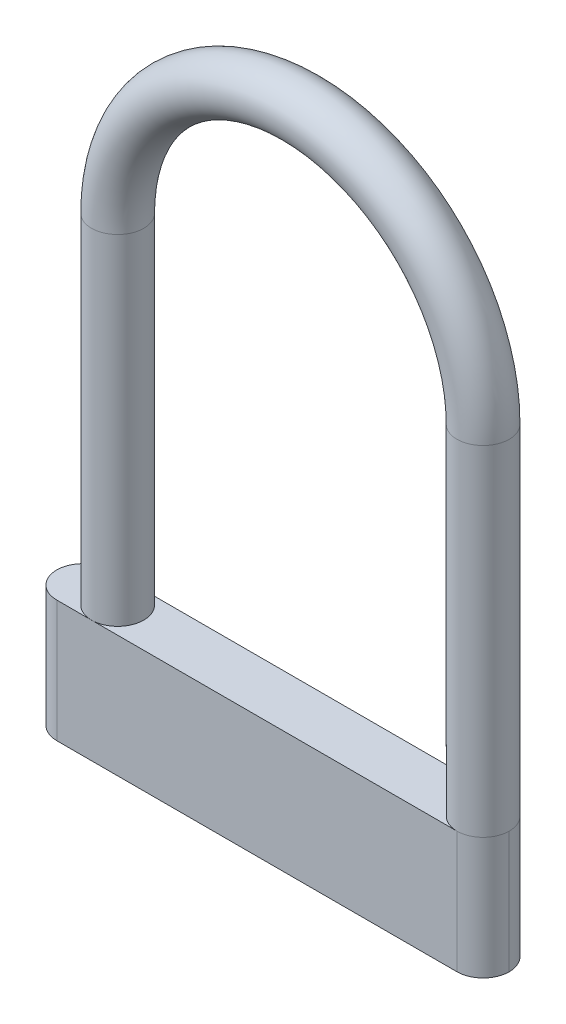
ISO-10303-21;
HEADER;
FILE_DESCRIPTION(('STEP AP214'),'2;1');
FILE_NAME('part.step','',(''),(''),'','','');
FILE_SCHEMA(('AUTOMOTIVE_DESIGN { 1 0 10303 214 1 1 1 1 }'));
ENDSEC;
DATA;
#1=APPLICATION_CONTEXT('core data for automotive mechanical design processes');
#2=APPLICATION_PROTOCOL_DEFINITION('international standard','automotive_design',2000,#1);
#3=PRODUCT_CONTEXT('',#1,'mechanical');
#4=PRODUCT('Part','Part','',(#3));
#5=PRODUCT_RELATED_PRODUCT_CATEGORY('part','',(#4));
#6=PRODUCT_DEFINITION_FORMATION('','',#4);
#7=PRODUCT_DEFINITION_CONTEXT('part definition',#1,'design');
#8=PRODUCT_DEFINITION('design','',#6,#7);
#9=PRODUCT_DEFINITION_SHAPE('','',#8);
#10=(LENGTH_UNIT() NAMED_UNIT(*) SI_UNIT(.MILLI.,.METRE.));
#11=(NAMED_UNIT(*) PLANE_ANGLE_UNIT() SI_UNIT($,.RADIAN.));
#12=(NAMED_UNIT(*) SI_UNIT($,.STERADIAN.) SOLID_ANGLE_UNIT());
#13=UNCERTAINTY_MEASURE_WITH_UNIT(LENGTH_MEASURE(1.E-05),#10,'distance_accuracy_value','');
#14=(GEOMETRIC_REPRESENTATION_CONTEXT(3) GLOBAL_UNCERTAINTY_ASSIGNED_CONTEXT((#13)) GLOBAL_UNIT_ASSIGNED_CONTEXT((#10,
#11,#12)) REPRESENTATION_CONTEXT('',''));
#15=CARTESIAN_POINT('',(0.,0.,0.));
#16=DIRECTION('',(0.,0.,1.));
#17=DIRECTION('',(1.,0.,0.));
#18=AXIS2_PLACEMENT_3D('',#15,#16,#17);
#19=CARTESIAN_POINT('',(21.,19.5,0.));
#20=DIRECTION('',(0.,-1.,0.));
#21=DIRECTION('',(1.,0.,0.));
#22=AXIS2_PLACEMENT_3D('',#19,#20,#21);
#23=CYLINDRICAL_SURFACE('',#22,1.5);
#24=CARTESIAN_POINT('',(21.,19.5,0.));
#25=DIRECTION('',(0.,-1.,0.));
#26=DIRECTION('',(0.,0.,1.));
#27=AXIS2_PLACEMENT_3D('',#24,#25,#26);
#28=CIRCLE('',#27,1.5);
#29=CARTESIAN_POINT('',(22.5,19.5,0.));
#30=VERTEX_POINT('',#29);
#31=EDGE_CURVE('E110',#30,#30,#28,.T.);
#32=ORIENTED_EDGE('',*,*,#31,.T.);
#33=EDGE_LOOP('',(#32));
#34=FACE_BOUND('',#33,.T.);
#35=CARTESIAN_POINT('',(21.,0.,0.));
#36=DIRECTION('',(0.,-1.,0.));
#37=DIRECTION('',(0.,0.,1.));
#38=AXIS2_PLACEMENT_3D('',#35,#36,#37);
#39=CIRCLE('',#38,1.5);
#40=CARTESIAN_POINT('',(21.,0.,1.5));
#41=VERTEX_POINT('',#40);
#42=CARTESIAN_POINT('',(21.,0.,-1.5));
#43=VERTEX_POINT('',#42);
#44=EDGE_CURVE('E101',#41,#43,#39,.T.);
#45=ORIENTED_EDGE('',*,*,#44,.F.);
#46=CARTESIAN_POINT('',(22.5,0.,0.));
#47=VERTEX_POINT('',#46);
#48=EDGE_CURVE('E102',#47,#41,#39,.T.);
#49=ORIENTED_EDGE('',*,*,#48,.F.);
#50=EDGE_CURVE('E105',#43,#47,#39,.T.);
#51=ORIENTED_EDGE('',*,*,#50,.F.);
#52=EDGE_LOOP('',(#45,#49,#51));
#53=FACE_BOUND('',#52,.T.);
#54=ADVANCED_FACE('F30',(#34,#53),#23,.T.);
#55=CARTESIAN_POINT('',(10.5,19.5,0.));
#56=DIRECTION('',(0.,0.,-1.));
#57=DIRECTION('',(-1.,0.,0.));
#58=AXIS2_PLACEMENT_3D('',#55,#56,#57);
#59=TOROIDAL_SURFACE('',#58,10.5,1.5);
#60=CARTESIAN_POINT('',(0.,19.5,0.));
#61=DIRECTION('',(0.,1.,0.));
#62=DIRECTION('',(0.,0.,1.));
#63=AXIS2_PLACEMENT_3D('',#60,#61,#62);
#64=CIRCLE('',#63,1.5);
#65=CARTESIAN_POINT('',(-1.5,19.5,0.));
#66=VERTEX_POINT('',#65);
#67=EDGE_CURVE('E164',#66,#66,#64,.T.);
#68=CARTESIAN_POINT('',(10.5,19.5,0.));
#69=DIRECTION('',(0.,0.,-1.));
#70=DIRECTION('',(-1.,0.,0.));
#71=AXIS2_PLACEMENT_3D('',#68,#69,#70);
#72=CIRCLE('',#71,12.);
#73=EDGE_CURVE('',#66,#30,#72,.T.);
#74=ORIENTED_EDGE('',*,*,#67,.T.);
#75=ORIENTED_EDGE('',*,*,#31,.F.);
#76=ORIENTED_EDGE('',*,*,#73,.T.);
#77=ORIENTED_EDGE('',*,*,#73,.F.);
#78=EDGE_LOOP('',(#74,#76,#75,#77));
#79=FACE_BOUND('',#78,.T.);
#80=ADVANCED_FACE('F169',(#79),#59,.T.);
#81=CARTESIAN_POINT('',(0.,19.5,0.));
#82=DIRECTION('',(0.,-1.,0.));
#83=DIRECTION('',(0.,0.,-1.));
#84=AXIS2_PLACEMENT_3D('',#81,#82,#83);
#85=CYLINDRICAL_SURFACE('',#84,1.5);
#86=ORIENTED_EDGE('',*,*,#67,.F.);
#87=EDGE_LOOP('',(#86));
#88=FACE_BOUND('',#87,.T.);
#89=CARTESIAN_POINT('',(0.,0.,0.));
#90=DIRECTION('',(0.,1.,0.));
#91=DIRECTION('',(0.,0.,1.));
#92=AXIS2_PLACEMENT_3D('',#89,#90,#91);
#93=CIRCLE('',#92,1.5);
#94=CARTESIAN_POINT('',(0.,0.,1.5));
#95=VERTEX_POINT('',#94);
#96=CARTESIAN_POINT('',(0.,0.,-1.5));
#97=VERTEX_POINT('',#96);
#98=EDGE_CURVE('E114',#95,#97,#93,.T.);
#99=ORIENTED_EDGE('',*,*,#98,.T.);
#100=EDGE_CURVE('E121',#97,#95,#93,.T.);
#101=ORIENTED_EDGE('',*,*,#100,.T.);
#102=EDGE_LOOP('',(#99,#101));
#103=FACE_BOUND('',#102,.T.);
#104=ADVANCED_FACE('F167',(#88,#103),#85,.T.);
#105=CARTESIAN_POINT('',(-3.5,0.,-1.5));
#106=DIRECTION('',(0.,-1.,0.));
#107=DIRECTION('',(0.,0.,-1.));
#108=AXIS2_PLACEMENT_3D('',#105,#106,#107);
#109=PLANE('',#108);
#110=DIRECTION('',(1.,0.,0.));
#111=VECTOR('',#110,1.);
#112=CARTESIAN_POINT('',(-3.5,0.,1.5));
#113=LINE('',#112,#111);
#114=EDGE_CURVE('E92',#95,#41,#113,.T.);
#115=ORIENTED_EDGE('',*,*,#114,.T.);
#116=ORIENTED_EDGE('',*,*,#44,.T.);
#117=DIRECTION('',(-1.,0.,0.));
#118=VECTOR('',#117,1.);
#119=CARTESIAN_POINT('',(-3.5,0.,-1.5));
#120=LINE('',#119,#118);
#121=EDGE_CURVE('E153',#43,#97,#120,.T.);
#122=ORIENTED_EDGE('',*,*,#121,.T.);
#123=ORIENTED_EDGE('',*,*,#98,.F.);
#124=EDGE_LOOP('',(#115,#116,#122,#123));
#125=FACE_BOUND('',#124,.T.);
#126=ADVANCED_FACE('F112',(#125),#109,.F.);
#127=CARTESIAN_POINT('',(-3.5,-7.,-1.5));
#128=DIRECTION('',(0.,0.,-1.));
#129=DIRECTION('',(-1.,0.,0.));
#130=AXIS2_PLACEMENT_3D('',#127,#128,#129);
#131=PLANE('',#130);
#132=DIRECTION('',(-1.,0.,0.));
#133=VECTOR('',#132,1.);
#134=CARTESIAN_POINT('',(-3.5,-7.,-1.5));
#135=LINE('',#134,#133);
#136=CARTESIAN_POINT('',(21.,-7.,-1.5));
#137=VERTEX_POINT('',#136);
#138=CARTESIAN_POINT('',(-2.,-7.,-1.5));
#139=VERTEX_POINT('',#138);
#140=EDGE_CURVE('E120',#137,#139,#135,.T.);
#141=ORIENTED_EDGE('',*,*,#140,.T.);
#142=DIRECTION('',(0.,1.,0.));
#143=VECTOR('',#142,1.);
#144=CARTESIAN_POINT('',(-2.,-7.,-1.5));
#145=LINE('',#144,#143);
#146=CARTESIAN_POINT('',(-2.,0.,-1.5));
#147=VERTEX_POINT('',#146);
#148=EDGE_CURVE('E129',#139,#147,#145,.T.);
#149=ORIENTED_EDGE('',*,*,#148,.T.);
#150=EDGE_CURVE('E158',#97,#147,#120,.T.);
#151=ORIENTED_EDGE('',*,*,#150,.F.);
#152=ORIENTED_EDGE('',*,*,#121,.F.);
#153=DIRECTION('',(0.,1.,0.));
#154=VECTOR('',#153,1.);
#155=CARTESIAN_POINT('',(21.,-7.,-1.5));
#156=LINE('',#155,#154);
#157=EDGE_CURVE('E109',#43,#137,#156,.F.);
#158=ORIENTED_EDGE('',*,*,#157,.T.);
#159=EDGE_LOOP('',(#141,#149,#151,#152,#158));
#160=FACE_BOUND('',#159,.T.);
#161=ADVANCED_FACE('F150',(#160),#131,.T.);
#162=CARTESIAN_POINT('',(-3.5,-7.,1.5));
#163=DIRECTION('',(0.,0.,1.));
#164=DIRECTION('',(1.,0.,0.));
#165=AXIS2_PLACEMENT_3D('',#162,#163,#164);
#166=PLANE('',#165);
#167=CARTESIAN_POINT('',(-2.,0.,1.5));
#168=VERTEX_POINT('',#167);
#169=EDGE_CURVE('E116',#168,#95,#113,.T.);
#170=ORIENTED_EDGE('',*,*,#169,.F.);
#171=DIRECTION('',(0.,1.,0.));
#172=VECTOR('',#171,1.);
#173=CARTESIAN_POINT('',(-2.,-7.,1.5));
#174=LINE('',#173,#172);
#175=CARTESIAN_POINT('',(-2.,-7.,1.5));
#176=VERTEX_POINT('',#175);
#177=EDGE_CURVE('E11',#168,#176,#174,.F.);
#178=ORIENTED_EDGE('',*,*,#177,.T.);
#179=DIRECTION('',(1.,0.,0.));
#180=VECTOR('',#179,1.);
#181=CARTESIAN_POINT('',(-3.5,-7.,1.5));
#182=LINE('',#181,#180);
#183=CARTESIAN_POINT('',(21.,-7.,1.5));
#184=VERTEX_POINT('',#183);
#185=EDGE_CURVE('E94',#176,#184,#182,.T.);
#186=ORIENTED_EDGE('',*,*,#185,.T.);
#187=DIRECTION('',(0.,1.,0.));
#188=VECTOR('',#187,1.);
#189=CARTESIAN_POINT('',(21.,-7.,1.5));
#190=LINE('',#189,#188);
#191=EDGE_CURVE('E39',#184,#41,#190,.T.);
#192=ORIENTED_EDGE('',*,*,#191,.T.);
#193=ORIENTED_EDGE('',*,*,#114,.F.);
#194=EDGE_LOOP('',(#170,#178,#186,#192,#193));
#195=FACE_BOUND('',#194,.T.);
#196=ADVANCED_FACE('F90',(#195),#166,.T.);
#197=CARTESIAN_POINT('',(-3.5,-7.,-1.5));
#198=DIRECTION('',(0.,-1.,0.));
#199=DIRECTION('',(0.,0.,-1.));
#200=AXIS2_PLACEMENT_3D('',#197,#198,#199);
#201=PLANE('',#200);
#202=CARTESIAN_POINT('',(-2.,-7.,0.));
#203=DIRECTION('',(0.,-1.,0.));
#204=DIRECTION('',(0.,0.,-1.));
#205=AXIS2_PLACEMENT_3D('',#202,#203,#204);
#206=CIRCLE('',#205,1.5);
#207=CARTESIAN_POINT('',(-3.5,-7.,0.));
#208=VERTEX_POINT('',#207);
#209=EDGE_CURVE('E139',#176,#208,#206,.T.);
#210=ORIENTED_EDGE('',*,*,#209,.T.);
#211=CARTESIAN_POINT('',(-2.,-7.,0.));
#212=DIRECTION('',(0.,-1.,0.));
#213=DIRECTION('',(0.,0.,-1.));
#214=AXIS2_PLACEMENT_3D('',#211,#212,#213);
#215=CIRCLE('',#214,1.5);
#216=EDGE_CURVE('E97',#208,#139,#215,.T.);
#217=ORIENTED_EDGE('',*,*,#216,.T.);
#218=ORIENTED_EDGE('',*,*,#140,.F.);
#219=CARTESIAN_POINT('',(21.,-7.,0.));
#220=DIRECTION('',(0.,-1.,0.));
#221=DIRECTION('',(0.,0.,-1.));
#222=AXIS2_PLACEMENT_3D('',#219,#220,#221);
#223=CIRCLE('',#222,1.5);
#224=CARTESIAN_POINT('',(22.5,-7.,0.));
#225=VERTEX_POINT('',#224);
#226=EDGE_CURVE('E137',#137,#225,#223,.T.);
#227=ORIENTED_EDGE('',*,*,#226,.T.);
#228=CARTESIAN_POINT('',(21.,-7.,0.));
#229=DIRECTION('',(0.,-1.,0.));
#230=DIRECTION('',(0.,0.,-1.));
#231=AXIS2_PLACEMENT_3D('',#228,#229,#230);
#232=CIRCLE('',#231,1.5);
#233=EDGE_CURVE('E47',#225,#184,#232,.T.);
#234=ORIENTED_EDGE('',*,*,#233,.T.);
#235=ORIENTED_EDGE('',*,*,#185,.F.);
#236=EDGE_LOOP('',(#210,#217,#218,#227,#234,#235));
#237=FACE_BOUND('',#236,.T.);
#238=ADVANCED_FACE('F154',(#237),#201,.T.);
#239=ORIENTED_EDGE('',*,*,#150,.T.);
#240=CARTESIAN_POINT('',(-2.,0.,0.));
#241=DIRECTION('',(0.,-1.,0.));
#242=DIRECTION('',(0.,0.,-1.));
#243=AXIS2_PLACEMENT_3D('',#240,#241,#242);
#244=CIRCLE('',#243,1.5);
#245=CARTESIAN_POINT('',(-3.5,0.,0.));
#246=VERTEX_POINT('',#245);
#247=EDGE_CURVE('E134',#147,#246,#244,.F.);
#248=ORIENTED_EDGE('',*,*,#247,.T.);
#249=CARTESIAN_POINT('',(-2.,0.,0.));
#250=DIRECTION('',(0.,-1.,0.));
#251=DIRECTION('',(0.,0.,-1.));
#252=AXIS2_PLACEMENT_3D('',#249,#250,#251);
#253=CIRCLE('',#252,1.5);
#254=EDGE_CURVE('E132',#246,#168,#253,.F.);
#255=ORIENTED_EDGE('',*,*,#254,.T.);
#256=ORIENTED_EDGE('',*,*,#169,.T.);
#257=ORIENTED_EDGE('',*,*,#100,.F.);
#258=EDGE_LOOP('',(#239,#248,#255,#256,#257));
#259=FACE_BOUND('',#258,.T.);
#260=ADVANCED_FACE('F160',(#259),#109,.F.);
#261=CARTESIAN_POINT('',(-2.,-7.,0.));
#262=DIRECTION('',(0.,1.,0.));
#263=DIRECTION('',(0.,0.,1.));
#264=AXIS2_PLACEMENT_3D('',#261,#262,#263);
#265=CYLINDRICAL_SURFACE('',#264,1.5);
#266=DIRECTION('',(0.,1.,0.));
#267=VECTOR('',#266,1.);
#268=CARTESIAN_POINT('',(-3.5,-7.,0.));
#269=LINE('',#268,#267);
#270=EDGE_CURVE('E117',#208,#246,#269,.T.);
#271=ORIENTED_EDGE('',*,*,#270,.F.);
#272=ORIENTED_EDGE('',*,*,#209,.F.);
#273=ORIENTED_EDGE('',*,*,#177,.F.);
#274=ORIENTED_EDGE('',*,*,#254,.F.);
#275=EDGE_LOOP('',(#271,#272,#273,#274));
#276=FACE_BOUND('',#275,.T.);
#277=ADVANCED_FACE('F190',(#276),#265,.T.);
#278=CARTESIAN_POINT('',(-2.,-7.,0.));
#279=DIRECTION('',(0.,1.,0.));
#280=DIRECTION('',(0.,0.,1.));
#281=AXIS2_PLACEMENT_3D('',#278,#279,#280);
#282=CYLINDRICAL_SURFACE('',#281,1.5);
#283=ORIENTED_EDGE('',*,*,#216,.F.);
#284=ORIENTED_EDGE('',*,*,#270,.T.);
#285=ORIENTED_EDGE('',*,*,#247,.F.);
#286=ORIENTED_EDGE('',*,*,#148,.F.);
#287=EDGE_LOOP('',(#283,#284,#285,#286));
#288=FACE_BOUND('',#287,.T.);
#289=ADVANCED_FACE('F156',(#288),#282,.T.);
#290=CARTESIAN_POINT('',(21.,-7.,0.));
#291=DIRECTION('',(0.,1.,0.));
#292=DIRECTION('',(0.,0.,1.));
#293=AXIS2_PLACEMENT_3D('',#290,#291,#292);
#294=CYLINDRICAL_SURFACE('',#293,1.5);
#295=ORIENTED_EDGE('',*,*,#191,.F.);
#296=ORIENTED_EDGE('',*,*,#233,.F.);
#297=DIRECTION('',(0.,1.,0.));
#298=VECTOR('',#297,1.);
#299=CARTESIAN_POINT('',(22.5,-7.,0.));
#300=LINE('',#299,#298);
#301=EDGE_CURVE('E34',#47,#225,#300,.F.);
#302=ORIENTED_EDGE('',*,*,#301,.F.);
#303=ORIENTED_EDGE('',*,*,#48,.T.);
#304=EDGE_LOOP('',(#295,#296,#302,#303));
#305=FACE_BOUND('',#304,.T.);
#306=ADVANCED_FACE('F32',(#305),#294,.T.);
#307=CARTESIAN_POINT('',(21.,-7.,0.));
#308=DIRECTION('',(0.,1.,0.));
#309=DIRECTION('',(0.,0.,1.));
#310=AXIS2_PLACEMENT_3D('',#307,#308,#309);
#311=CYLINDRICAL_SURFACE('',#310,1.5);
#312=ORIENTED_EDGE('',*,*,#226,.F.);
#313=ORIENTED_EDGE('',*,*,#157,.F.);
#314=ORIENTED_EDGE('',*,*,#50,.T.);
#315=ORIENTED_EDGE('',*,*,#301,.T.);
#316=EDGE_LOOP('',(#312,#313,#314,#315));
#317=FACE_BOUND('',#316,.T.);
#318=ADVANCED_FACE('F146',(#317),#311,.T.);
#319=CLOSED_SHELL('',(#54,#80,#104,#126,#161,#196,#238,#260,#277,#289,#306,#318));
#320=MANIFOLD_SOLID_BREP('B2',#319);
#321=ADVANCED_BREP_SHAPE_REPRESENTATION('',(#18,#320),#14);
#322=SHAPE_DEFINITION_REPRESENTATION(#9,#321);
ENDSEC;
END-ISO-10303-21;
